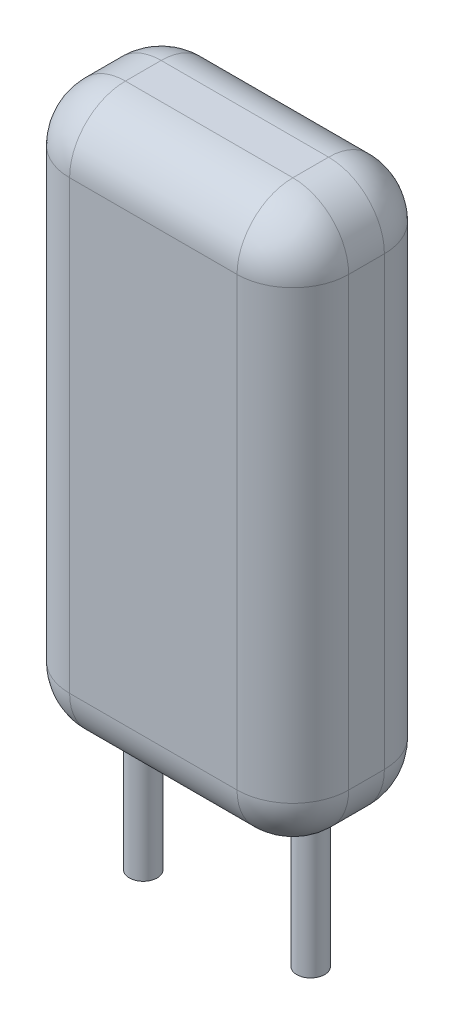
from build123d import *

# Parameters (mm, degrees)
ESQUISSE1_W      = 2.64
ESQUISSE1_H      = 10
EXTRUSION1_DEPTH = 5
CONG_1_R         = 1
ESQUISSE2_R      = 0.25
EXTRUSION2_DEPTH = 2.4


with BuildPart() as part:
    # Esquisse1 → Extrusion1 (new body)
    with BuildSketch(Plane(origin=(0, 0, 0), x_dir=(0, 0, -1), z_dir=(1, 0, 0))):
        with Locations((0, 5)):
            Rectangle(ESQUISSE1_W, ESQUISSE1_H)
    extrude(amount=EXTRUSION1_DEPTH)

    # Cong_1
    cong_1_edges = [part.edges().sort_by_distance(p)[0] for p in [
        (5, 5, -1.32),
        (5, 10, 0),
        (5, 5, 1.32),
        (0, 10, 0),
        (0, 5, -1.32),
        (0, 0, 0),
        (0, 5, 1.32),
        (5, 0, 0),
        (2.5, 10, 1.32),
        (2.5, 10, -1.32),
        (2.5, 0, -1.32),
        (2.5, 0, 1.32),
    ]]
    fillet(cong_1_edges, radius=CONG_1_R)

    # Esquisse2 → Extrusion2 (add)
    with BuildSketch(Plane.XZ):
        with Locations(Location((4, 0, 0), (0, 0, 270))):
            Circle(ESQUISSE2_R)
        with Locations(Location((1, 0, 0), (0, 0, 270))):
            Circle(ESQUISSE2_R)
    extrude(amount=EXTRUSION2_DEPTH)


solid = part.part
